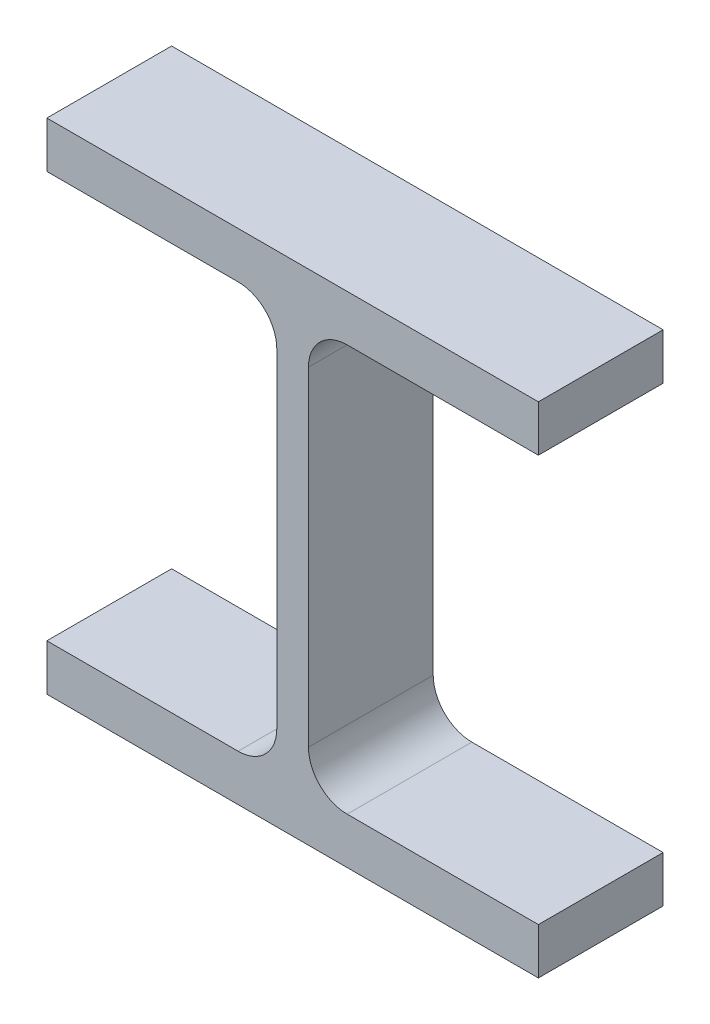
from build123d import *

# Parameters (mm, degrees)
BASESTEELM_DEPTH = 12.7


with BuildPart() as part:
    # Sketch1 → BaseSteelM (new, symmetric)
    with BuildSketch(Plane.XY):
        with BuildLine():
            Line((0, 0), (0, 9.4234))
            Line((0, 9.4234), (38.9382, 9.4234))
            ThreePointArc((38.9382, 9.4234), (44.505958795, 11.729641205), (46.8122, 17.2974))
            Line((46.8122, 17.2974), (46.8122, 84.3026))
            ThreePointArc((46.8122, 84.3026), (44.505958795, 89.870358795), (38.9382, 92.1766))
            Line((38.9382, 92.1766), (0, 92.1766))
            Line((0, 92.1766), (0, 101.6))
            Line((0, 101.6), (100.076, 101.6))
            Line((100.076, 101.6), (100.076, 92.1766))
            Line((100.076, 92.1766), (61.1378, 92.1766))
            ThreePointArc((61.1378, 92.1766), (55.570041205, 89.870358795), (53.2638, 84.3026))
            Line((53.2638, 84.3026), (53.2638, 17.2974))
            ThreePointArc((53.2638, 17.2974), (55.570041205, 11.729641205), (61.1378, 9.4234))
            Line((61.1378, 9.4234), (100.076, 9.4234))
            Line((100.076, 9.4234), (100.076, 0))
            Line((100.076, 0), (0, 0))
        make_face()
    extrude(amount=BASESTEELM_DEPTH, both=True)


solid = part.part
